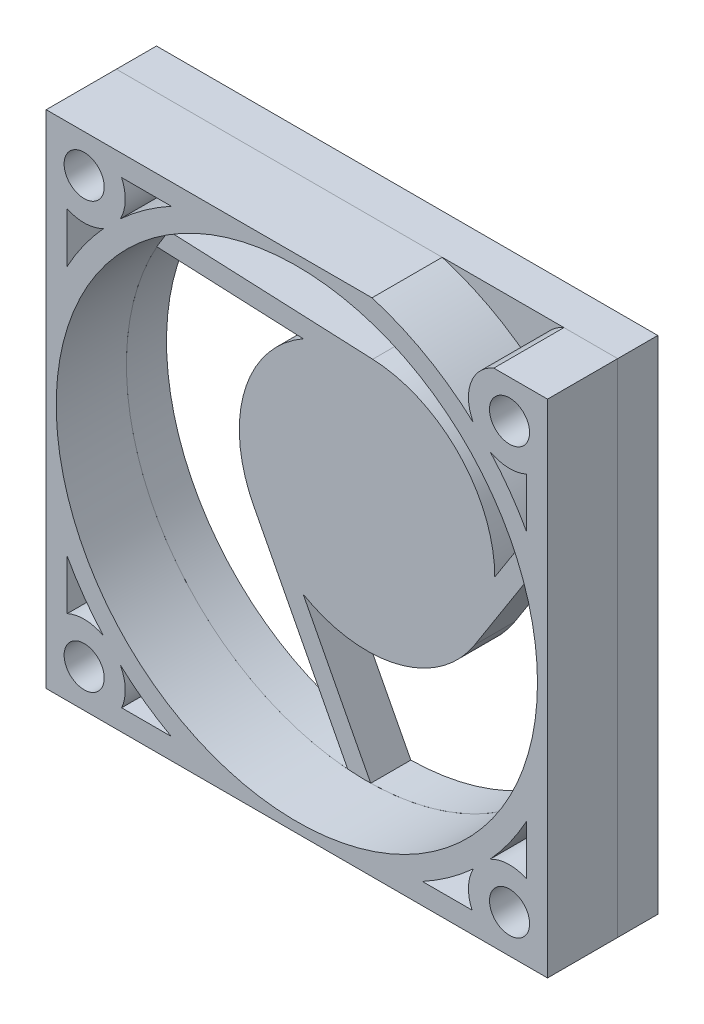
from build123d import *

# Parameters (mm, degrees)
ESQUISSE1_W             = 50
ESQUISSE1_H             = 50
ESQUISSE1_R             = 2
ESQUISSE1_R_2           = 24
EXTRUSION1_DEPTH        = 7
ESQUISSE2_W             = 50
ESQUISSE2_H             = 50
ESQUISSE2_R             = 2
EXTRUSION3_DEPTH        = 4
COQUE2_T                = -2.1
ENL_V_MAT_EXTRU_3_DEPTH = 37.041642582


with BuildPart() as part:
    # Esquisse1 → Extrusion1 (new body)
    with BuildSketch(Plane.XY):
        Rectangle(ESQUISSE1_W, ESQUISSE1_H)
        with Locations((-21.213203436, 21.213203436)):
            Circle(ESQUISSE1_R, mode=Mode.SUBTRACT)
        Circle(ESQUISSE1_R_2, mode=Mode.SUBTRACT)
        with Locations((21.213203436, 21.213203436)):
            Circle(ESQUISSE1_R, mode=Mode.SUBTRACT)
        with Locations((21.213203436, -21.213203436)):
            Circle(ESQUISSE1_R, mode=Mode.SUBTRACT)
        with Locations((-21.213203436, -21.213203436)):
            Circle(ESQUISSE1_R, mode=Mode.SUBTRACT)
    extrude(amount=EXTRUSION1_DEPTH)

    # Coque2
    coque2_openings = [part.faces().sort_by_distance(p)[0] for p in [
        (0, 24.292893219, 7),
    ]]
    offset(amount=COQUE2_T, openings=coque2_openings)

    # Esquisse4 → Enl_v. mat.-Extru.3 (cut, through all)
    with BuildSketch(Plane.XY):
        with BuildLine():
            Line((4.103389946, 25.775418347), (20.6985725, 25.280777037))
            ThreePointArc((20.6985725, 25.280777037), (17.568379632, 23.090770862), (17.602577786, 19.270683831))
            ThreePointArc((17.602577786, 19.270683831), (11.329834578, 23.512652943), (4.103389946, 25.775418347))
        make_face()
    extrude(amount=ENL_V_MAT_EXTRU_3_DEPTH, mode=Mode.SUBTRACT)


with BuildPart() as body_2:
    # Esquisse2 → Extrusion3 (new body)
    with BuildSketch(Plane.XY):
        Rectangle(ESQUISSE2_W, ESQUISSE2_H)
        with Locations((-21.213203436, 21.213203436)):
            Circle(ESQUISSE2_R, mode=Mode.SUBTRACT)
        with Locations((21.213203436, 21.213203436)):
            Circle(ESQUISSE2_R, mode=Mode.SUBTRACT)
        with Locations((21.213203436, -21.213203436)):
            Circle(ESQUISSE2_R, mode=Mode.SUBTRACT)
        with Locations((-21.213203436, -21.213203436)):
            Circle(ESQUISSE2_R, mode=Mode.SUBTRACT)
        with BuildLine():
            Line((10.739216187, -6.852507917), (21.680192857, 10.294136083))
            ThreePointArc((21.680192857, 10.294136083), (20.383798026, -12.668890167), (0.367531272, -23.997185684))
            Line((0.367531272, -23.997185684), (-6.369608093, -11.032484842))
            ThreePointArc((-6.369608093, -11.032484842), (3.023478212, -12.375225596), (10.739216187, -6.852507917))
        make_face(mode=Mode.SUBTRACT)
        with BuildLine():
            Line((20.598406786, 12.31688426), (12.739216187, 0))
            ThreePointArc((12.739216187, 0), (9.205520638, 8.806021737), (0.564837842, 12.726687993))
            Line((0.564837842, 12.726687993), (-19.755079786, 13.628529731))
            ThreePointArc((-19.755079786, 13.628529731), (0.779681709, 23.987331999), (20.598406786, 12.31688426))
        make_face(mode=Mode.SUBTRACT)
        with BuildLine():
            Line((-11.304054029, -5.874180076), (-1.92511307, -23.922665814))
            ThreePointArc((-1.92511307, -23.922665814), (-21.163479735, -11.318441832), (-20.965938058, 11.680301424))
            Line((-20.965938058, 11.680301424), (-6.369608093, 11.032484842))
            ThreePointArc((-6.369608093, 11.032484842), (-12.22899885, 3.569203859), (-11.304054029, -5.874180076))
        make_face(mode=Mode.SUBTRACT)
    extrude(amount=-EXTRUSION3_DEPTH)


solid = Compound([part.part, body_2.part])
